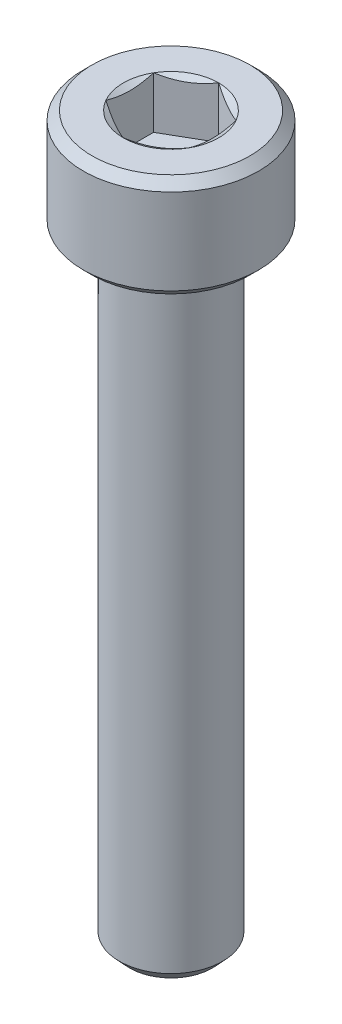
ISO-10303-21;
HEADER;
FILE_DESCRIPTION(('STEP AP214'),'2;1');
FILE_NAME('part.step','',(''),(''),'','','');
FILE_SCHEMA(('AUTOMOTIVE_DESIGN { 1 0 10303 214 1 1 1 1 }'));
ENDSEC;
DATA;
#1=APPLICATION_CONTEXT('core data for automotive mechanical design processes');
#2=APPLICATION_PROTOCOL_DEFINITION('international standard','automotive_design',2000,#1);
#3=PRODUCT_CONTEXT('',#1,'mechanical');
#4=PRODUCT('Part','Part','',(#3));
#5=PRODUCT_RELATED_PRODUCT_CATEGORY('part','',(#4));
#6=PRODUCT_DEFINITION_FORMATION('','',#4);
#7=PRODUCT_DEFINITION_CONTEXT('part definition',#1,'design');
#8=PRODUCT_DEFINITION('design','',#6,#7);
#9=PRODUCT_DEFINITION_SHAPE('','',#8);
#10=(LENGTH_UNIT() NAMED_UNIT(*) SI_UNIT(.MILLI.,.METRE.));
#11=(NAMED_UNIT(*) PLANE_ANGLE_UNIT() SI_UNIT($,.RADIAN.));
#12=(NAMED_UNIT(*) SI_UNIT($,.STERADIAN.) SOLID_ANGLE_UNIT());
#13=UNCERTAINTY_MEASURE_WITH_UNIT(LENGTH_MEASURE(1.E-05),#10,'distance_accuracy_value','');
#14=(GEOMETRIC_REPRESENTATION_CONTEXT(3) GLOBAL_UNCERTAINTY_ASSIGNED_CONTEXT((#13)) GLOBAL_UNIT_ASSIGNED_CONTEXT((#10,
#11,#12)) REPRESENTATION_CONTEXT('',''));
#15=CARTESIAN_POINT('',(0.,0.,0.));
#16=DIRECTION('',(0.,0.,1.));
#17=DIRECTION('',(1.,0.,0.));
#18=AXIS2_PLACEMENT_3D('',#15,#16,#17);
#19=CARTESIAN_POINT('',(0.,2.49999999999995,-2.3094010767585));
#20=DIRECTION('',(0.,1.,0.));
#21=DIRECTION('',(-1.,0.,0.));
#22=AXIS2_PLACEMENT_3D('',#19,#20,#21);
#23=PLANE('',#22);
#24=DIRECTION('',(0.866025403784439,0.,-0.499999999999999));
#25=VECTOR('',#24,1.);
#26=CARTESIAN_POINT('',(0.,2.49999999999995,2.3094010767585));
#27=LINE('',#26,#25);
#28=CARTESIAN_POINT('',(0.,2.49999999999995,2.30940107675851));
#29=VERTEX_POINT('',#28);
#30=CARTESIAN_POINT('',(2.,2.49999999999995,1.15470053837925));
#31=VERTEX_POINT('',#30);
#32=EDGE_CURVE('E85',#29,#31,#27,.T.);
#33=ORIENTED_EDGE('',*,*,#32,.T.);
#34=DIRECTION('',(0.,0.,1.));
#35=VECTOR('',#34,1.);
#36=CARTESIAN_POINT('',(2.,2.49999999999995,1.15470053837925));
#37=LINE('',#36,#35);
#38=CARTESIAN_POINT('',(2.,2.49999999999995,-1.15470053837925));
#39=VERTEX_POINT('',#38);
#40=EDGE_CURVE('E71',#31,#39,#37,.F.);
#41=ORIENTED_EDGE('',*,*,#40,.T.);
#42=DIRECTION('',(-0.866025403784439,0.,-0.5));
#43=VECTOR('',#42,1.);
#44=CARTESIAN_POINT('',(2.,2.49999999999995,-1.15470053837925));
#45=LINE('',#44,#43);
#46=CARTESIAN_POINT('',(0.,2.49999999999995,-2.3094010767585));
#47=VERTEX_POINT('',#46);
#48=EDGE_CURVE('E110',#39,#47,#45,.T.);
#49=ORIENTED_EDGE('',*,*,#48,.T.);
#50=DIRECTION('',(-0.86602540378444,0.,0.499999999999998));
#51=VECTOR('',#50,1.);
#52=CARTESIAN_POINT('',(0.,2.49999999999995,-2.3094010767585));
#53=LINE('',#52,#51);
#54=CARTESIAN_POINT('',(-2.,2.49999999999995,-1.15470053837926));
#55=VERTEX_POINT('',#54);
#56=EDGE_CURVE('E115',#47,#55,#53,.T.);
#57=ORIENTED_EDGE('',*,*,#56,.T.);
#58=DIRECTION('',(0.,0.,1.));
#59=VECTOR('',#58,1.);
#60=CARTESIAN_POINT('',(-2.,2.49999999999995,-1.15470053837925));
#61=LINE('',#60,#59);
#62=CARTESIAN_POINT('',(-2.,2.49999999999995,1.15470053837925));
#63=VERTEX_POINT('',#62);
#64=EDGE_CURVE('E82',#55,#63,#61,.T.);
#65=ORIENTED_EDGE('',*,*,#64,.T.);
#66=DIRECTION('',(0.866025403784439,0.,0.5));
#67=VECTOR('',#66,1.);
#68=CARTESIAN_POINT('',(-2.,2.49999999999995,1.15470053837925));
#69=LINE('',#68,#67);
#70=EDGE_CURVE('E84',#63,#29,#69,.T.);
#71=ORIENTED_EDGE('',*,*,#70,.T.);
#72=EDGE_LOOP('',(#33,#41,#49,#57,#65,#71));
#73=FACE_BOUND('',#72,.T.);
#74=ADVANCED_FACE('F17',(#73),#23,.T.);
#75=CARTESIAN_POINT('',(0.,2.49999999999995,2.3094010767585));
#76=DIRECTION('',(0.499999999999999,0.,0.866025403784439));
#77=DIRECTION('',(0.866025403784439,0.,-0.499999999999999));
#78=AXIS2_PLACEMENT_3D('',#75,#76,#77);
#79=PLANE('',#78);
#80=CARTESIAN_POINT('',(6.85276251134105E-12,5.00000000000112,2.30940107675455));
#81=CARTESIAN_POINT('',(0.087887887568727,4.97069554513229,2.25865898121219));
#82=CARTESIAN_POINT('',(0.176534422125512,4.94404467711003,2.20747888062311));
#83=CARTESIAN_POINT('',(0.355362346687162,4.89752638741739,2.10423253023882));
#84=CARTESIAN_POINT('',(0.445546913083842,4.87767542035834,2.05216444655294));
#85=CARTESIAN_POINT('',(0.624798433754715,4.84677595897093,1.94867353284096));
#86=CARTESIAN_POINT('',(0.713837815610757,4.83552178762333,1.8972666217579));
#87=CARTESIAN_POINT('',(0.892335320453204,4.82208916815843,1.79421103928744));
#88=CARTESIAN_POINT('',(0.981792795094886,4.81989959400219,1.74256274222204));
#89=CARTESIAN_POINT('',(1.14893448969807,4.82446629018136,1.64606343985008));
#90=CARTESIAN_POINT('',(1.2266437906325,4.83010128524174,1.60119795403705));
#91=CARTESIAN_POINT('',(1.38155614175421,4.84795730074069,1.51175926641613));
#92=CARTESIAN_POINT('',(1.45875865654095,4.86018441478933,1.46718637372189));
#93=CARTESIAN_POINT('',(1.61399014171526,4.89074983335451,1.3775634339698));
#94=CARTESIAN_POINT('',(1.69199947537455,4.90921764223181,1.3325247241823));
#95=CARTESIAN_POINT('',(1.84685496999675,4.951131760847,1.24311886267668));
#96=CARTESIAN_POINT('',(1.92370311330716,4.97456822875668,1.19875056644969));
#97=CARTESIAN_POINT('',(1.99999999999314,5.00000000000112,1.15470053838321));
#98=B_SPLINE_CURVE_WITH_KNOTS('',3,(#80,#81,#82,#83,#84,#85,#86,#87,#88,#89,#90,#91,#92,#93,#94,
#95,#96,#97),.UNSPECIFIED.,.F.,.F.,(4,2,2,2,2,2,2,2,4),(0.,0.317016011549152,0.63479381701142,
0.944707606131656,1.25424088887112,1.52370778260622,1.79342419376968,2.0691216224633,
2.34427797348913),.UNSPECIFIED.);
#99=CARTESIAN_POINT('',(0.,4.99999999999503,2.309401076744));
#100=VERTEX_POINT('',#99);
#101=CARTESIAN_POINT('',(1.99999999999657,4.99999999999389,1.15470053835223));
#102=VERTEX_POINT('',#101);
#103=EDGE_CURVE('E20',#100,#102,#98,.T.);
#104=ORIENTED_EDGE('',*,*,#103,.T.);
#105=DIRECTION('',(0.,1.,0.));
#106=VECTOR('',#105,1.);
#107=CARTESIAN_POINT('',(2.,2.49999999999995,1.15470053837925));
#108=LINE('',#107,#106);
#109=EDGE_CURVE('E90',#102,#31,#108,.F.);
#110=ORIENTED_EDGE('',*,*,#109,.T.);
#111=ORIENTED_EDGE('',*,*,#32,.F.);
#112=DIRECTION('',(0.,1.,0.));
#113=VECTOR('',#112,1.);
#114=CARTESIAN_POINT('',(0.,2.49999999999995,2.3094010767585));
#115=LINE('',#114,#113);
#116=EDGE_CURVE('E58',#29,#100,#115,.T.);
#117=ORIENTED_EDGE('',*,*,#116,.T.);
#118=EDGE_LOOP('',(#104,#110,#111,#117));
#119=FACE_BOUND('',#118,.T.);
#120=ADVANCED_FACE('F89',(#119),#79,.F.);
#121=CARTESIAN_POINT('',(-2.,2.49999999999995,1.15470053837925));
#122=DIRECTION('',(-0.5,0.,0.866025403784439));
#123=DIRECTION('',(0.866025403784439,0.,0.5));
#124=AXIS2_PLACEMENT_3D('',#121,#122,#123);
#125=PLANE('',#124);
#126=CARTESIAN_POINT('',(-1.99999999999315,5.00000000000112,1.15470053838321));
#127=CARTESIAN_POINT('',(-1.91211211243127,4.97069554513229,1.20544263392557));
#128=CARTESIAN_POINT('',(-1.82346557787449,4.94404467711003,1.25662273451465));
#129=CARTESIAN_POINT('',(-1.64463765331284,4.89752638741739,1.35986908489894));
#130=CARTESIAN_POINT('',(-1.55445308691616,4.87767542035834,1.41193716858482));
#131=CARTESIAN_POINT('',(-1.37520156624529,4.84677595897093,1.51542808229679));
#132=CARTESIAN_POINT('',(-1.28616218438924,4.83552178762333,1.56683499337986));
#133=CARTESIAN_POINT('',(-1.1076646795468,4.82208916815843,1.66989057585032));
#134=CARTESIAN_POINT('',(-1.01820720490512,4.81989959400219,1.72153887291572));
#135=CARTESIAN_POINT('',(-0.851065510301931,4.82446629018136,1.81803817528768));
#136=CARTESIAN_POINT('',(-0.7733562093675,4.83010128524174,1.86290366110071));
#137=CARTESIAN_POINT('',(-0.618443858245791,4.84795730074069,1.95234234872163));
#138=CARTESIAN_POINT('',(-0.541241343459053,4.86018441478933,1.99691524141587));
#139=CARTESIAN_POINT('',(-0.386009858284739,4.89074983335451,2.08653818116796));
#140=CARTESIAN_POINT('',(-0.308000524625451,4.90921764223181,2.13157689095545));
#141=CARTESIAN_POINT('',(-0.15314503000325,4.951131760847,2.22098275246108));
#142=CARTESIAN_POINT('',(-0.076296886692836,4.97456822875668,2.26535104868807));
#143=CARTESIAN_POINT('',(-6.85765127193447E-12,5.00000000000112,2.30940107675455));
#144=B_SPLINE_CURVE_WITH_KNOTS('',3,(#126,#127,#128,#129,#130,#131,#132,#133,#134,#135,#136,
#137,#138,#139,#140,#141,#142,#143),.UNSPECIFIED.,.F.,.F.,(4,2,2,2,2,2,2,2,4),(0.,
0.317016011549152,0.634793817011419,0.944707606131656,1.25424088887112,1.52370778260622,
1.79342419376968,2.0691216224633,2.34427797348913),.UNSPECIFIED.);
#145=CARTESIAN_POINT('',(-1.99999999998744,4.99999999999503,1.154700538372));
#146=VERTEX_POINT('',#145);
#147=EDGE_CURVE('E94',#146,#100,#144,.T.);
#148=ORIENTED_EDGE('',*,*,#147,.T.);
#149=ORIENTED_EDGE('',*,*,#116,.F.);
#150=ORIENTED_EDGE('',*,*,#70,.F.);
#151=DIRECTION('',(0.,-1.,0.));
#152=VECTOR('',#151,1.);
#153=CARTESIAN_POINT('',(-2.,2.49999999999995,1.15470053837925));
#154=LINE('',#153,#152);
#155=EDGE_CURVE('E96',#63,#146,#154,.F.);
#156=ORIENTED_EDGE('',*,*,#155,.T.);
#157=EDGE_LOOP('',(#148,#149,#150,#156));
#158=FACE_BOUND('',#157,.T.);
#159=ADVANCED_FACE('F92',(#158),#125,.F.);
#160=CARTESIAN_POINT('',(-2.,2.49999999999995,-1.15470053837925));
#161=DIRECTION('',(-1.,0.,0.));
#162=DIRECTION('',(0.,-1.,0.));
#163=AXIS2_PLACEMENT_3D('',#160,#161,#162);
#164=PLANE('',#163);
#165=CARTESIAN_POINT('',(-2.,5.00000000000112,-1.15470053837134));
#166=CARTESIAN_POINT('',(-2.,4.97069554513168,-1.05321634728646));
#167=CARTESIAN_POINT('',(-2.,4.94404467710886,-0.950856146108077));
#168=CARTESIAN_POINT('',(-2.,4.89752638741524,-0.744363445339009));
#169=CARTESIAN_POINT('',(-2.,4.87767542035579,-0.640227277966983));
#170=CARTESIAN_POINT('',(-2.,4.84677595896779,-0.433245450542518));
#171=CARTESIAN_POINT('',(-2.,4.83552178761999,-0.330431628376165));
#172=CARTESIAN_POINT('',(-2.,4.82208916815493,-0.124320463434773));
#173=CARTESIAN_POINT('',(-2.,4.81989959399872,-0.0210238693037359));
#174=CARTESIAN_POINT('',(-2.,4.82446629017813,0.171974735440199));
#175=CARTESIAN_POINT('',(-2.,4.83010128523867,0.261705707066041));
#176=CARTESIAN_POINT('',(-2.,4.84795730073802,0.440583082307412));
#177=CARTESIAN_POINT('',(-2.,4.8601844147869,0.529728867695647));
#178=CARTESIAN_POINT('',(-2.,4.89074983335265,0.708974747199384));
#179=CARTESIAN_POINT('',(-2.,4.90921764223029,0.799052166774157));
#180=CARTESIAN_POINT('',(-2.,4.9511317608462,0.977863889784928));
#181=CARTESIAN_POINT('',(-2.,4.97456822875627,1.06660048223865));
#182=CARTESIAN_POINT('',(-2.,5.00000000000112,1.15470053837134));
#183=B_SPLINE_CURVE_WITH_KNOTS('',3,(#165,#166,#167,#168,#169,#170,#171,#172,#173,#174,#175,
#176,#177,#178,#179,#180,#181,#182),.UNSPECIFIED.,.F.,.F.,(4,2,2,2,2,2,2,2,4),(0.,
0.317016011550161,0.634793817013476,0.94470760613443,1.25424088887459,1.52370778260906,
1.79342419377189,2.06912162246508,2.34427797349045),.UNSPECIFIED.);
#184=CARTESIAN_POINT('',(-1.99999999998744,4.99999999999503,-1.15470053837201));
#185=VERTEX_POINT('',#184);
#186=EDGE_CURVE('E195',#185,#146,#183,.T.);
#187=ORIENTED_EDGE('',*,*,#186,.T.);
#188=ORIENTED_EDGE('',*,*,#155,.F.);
#189=ORIENTED_EDGE('',*,*,#64,.F.);
#190=DIRECTION('',(0.,1.,0.));
#191=VECTOR('',#190,1.);
#192=CARTESIAN_POINT('',(-2.,2.49999999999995,-1.15470053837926));
#193=LINE('',#192,#191);
#194=EDGE_CURVE('E112',#55,#185,#193,.T.);
#195=ORIENTED_EDGE('',*,*,#194,.T.);
#196=EDGE_LOOP('',(#187,#188,#189,#195));
#197=FACE_BOUND('',#196,.T.);
#198=ADVANCED_FACE('F204',(#197),#164,.F.);
#199=CARTESIAN_POINT('',(0.,2.49999999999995,-2.3094010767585));
#200=DIRECTION('',(-0.499999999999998,0.,-0.86602540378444));
#201=DIRECTION('',(-0.86602540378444,0.,0.499999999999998));
#202=AXIS2_PLACEMENT_3D('',#199,#200,#201);
#203=PLANE('',#202);
#204=CARTESIAN_POINT('',(-6.85499212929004E-12,5.00000000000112,-2.30940107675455));
#205=CARTESIAN_POINT('',(-0.0878878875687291,4.97069554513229,-2.25865898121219));
#206=CARTESIAN_POINT('',(-0.176534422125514,4.94404467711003,-2.2074788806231));
#207=CARTESIAN_POINT('',(-0.355362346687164,4.89752638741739,-2.10423253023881));
#208=CARTESIAN_POINT('',(-0.445546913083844,4.87767542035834,-2.05216444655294));
#209=CARTESIAN_POINT('',(-0.624798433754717,4.84677595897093,-1.94867353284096));
#210=CARTESIAN_POINT('',(-0.713837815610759,4.83552178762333,-1.8972666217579));
#211=CARTESIAN_POINT('',(-0.892335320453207,4.82208916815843,-1.79421103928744));
#212=CARTESIAN_POINT('',(-0.981792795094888,4.81989959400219,-1.74256274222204));
#213=CARTESIAN_POINT('',(-1.14893448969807,4.82446629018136,-1.64606343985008));
#214=CARTESIAN_POINT('',(-1.2266437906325,4.83010128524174,-1.60119795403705));
#215=CARTESIAN_POINT('',(-1.38155614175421,4.84795730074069,-1.51175926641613));
#216=CARTESIAN_POINT('',(-1.45875865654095,4.86018441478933,-1.4671863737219));
#217=CARTESIAN_POINT('',(-1.61399014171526,4.89074983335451,-1.3775634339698));
#218=CARTESIAN_POINT('',(-1.69199947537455,4.90921764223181,-1.33252472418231));
#219=CARTESIAN_POINT('',(-1.84685496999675,4.951131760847,-1.24311886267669));
#220=CARTESIAN_POINT('',(-1.92370311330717,4.97456822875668,-1.1987505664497));
#221=CARTESIAN_POINT('',(-1.99999999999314,5.00000000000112,-1.15470053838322));
#222=B_SPLINE_CURVE_WITH_KNOTS('',3,(#204,#205,#206,#207,#208,#209,#210,#211,#212,#213,#214,
#215,#216,#217,#218,#219,#220,#221),.UNSPECIFIED.,.F.,.F.,(4,2,2,2,2,2,2,2,4),(0.,
0.317016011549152,0.634793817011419,0.944707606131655,1.25424088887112,1.52370778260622,
1.79342419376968,2.0691216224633,2.34427797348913),.UNSPECIFIED.);
#223=CARTESIAN_POINT('',(0.,4.99999999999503,-2.309401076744));
#224=VERTEX_POINT('',#223);
#225=EDGE_CURVE('E188',#224,#185,#222,.T.);
#226=ORIENTED_EDGE('',*,*,#225,.T.);
#227=ORIENTED_EDGE('',*,*,#194,.F.);
#228=ORIENTED_EDGE('',*,*,#56,.F.);
#229=DIRECTION('',(0.,1.,0.));
#230=VECTOR('',#229,1.);
#231=CARTESIAN_POINT('',(0.,2.49999999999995,-2.3094010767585));
#232=LINE('',#231,#230);
#233=EDGE_CURVE('E107',#47,#224,#232,.T.);
#234=ORIENTED_EDGE('',*,*,#233,.T.);
#235=EDGE_LOOP('',(#226,#227,#228,#234));
#236=FACE_BOUND('',#235,.T.);
#237=ADVANCED_FACE('F200',(#236),#203,.F.);
#238=CARTESIAN_POINT('',(2.,2.49999999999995,-1.15470053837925));
#239=DIRECTION('',(0.5,0.,-0.866025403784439));
#240=DIRECTION('',(-0.866025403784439,0.,-0.5));
#241=AXIS2_PLACEMENT_3D('',#238,#239,#240);
#242=PLANE('',#241);
#243=CARTESIAN_POINT('',(1.99999999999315,5.00000000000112,-1.15470053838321));
#244=CARTESIAN_POINT('',(1.91211211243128,4.97069554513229,-1.20544263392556));
#245=CARTESIAN_POINT('',(1.82346557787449,4.94404467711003,-1.25662273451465));
#246=CARTESIAN_POINT('',(1.64463765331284,4.89752638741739,-1.35986908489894));
#247=CARTESIAN_POINT('',(1.55445308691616,4.87767542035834,-1.41193716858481));
#248=CARTESIAN_POINT('',(1.37520156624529,4.84677595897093,-1.51542808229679));
#249=CARTESIAN_POINT('',(1.28616218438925,4.83552178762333,-1.56683499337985));
#250=CARTESIAN_POINT('',(1.1076646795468,4.82208916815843,-1.66989057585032));
#251=CARTESIAN_POINT('',(1.01820720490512,4.81989959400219,-1.72153887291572));
#252=CARTESIAN_POINT('',(0.851065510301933,4.82446629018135,-1.81803817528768));
#253=CARTESIAN_POINT('',(0.773356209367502,4.83010128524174,-1.86290366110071));
#254=CARTESIAN_POINT('',(0.618443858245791,4.84795730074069,-1.95234234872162));
#255=CARTESIAN_POINT('',(0.541241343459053,4.86018441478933,-1.99691524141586));
#256=CARTESIAN_POINT('',(0.386009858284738,4.8907498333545,-2.08653818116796));
#257=CARTESIAN_POINT('',(0.30800052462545,4.90921764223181,-2.13157689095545));
#258=CARTESIAN_POINT('',(0.153145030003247,4.951131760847,-2.22098275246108));
#259=CARTESIAN_POINT('',(0.0762968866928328,4.97456822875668,-2.26535104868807));
#260=CARTESIAN_POINT('',(6.85395999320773E-12,5.00000000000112,-2.30940107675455));
#261=B_SPLINE_CURVE_WITH_KNOTS('',3,(#243,#244,#245,#246,#247,#248,#249,#250,#251,#252,#253,
#254,#255,#256,#257,#258,#259,#260),.UNSPECIFIED.,.F.,.F.,(4,2,2,2,2,2,2,2,4),(0.,
0.317016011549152,0.63479381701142,0.944707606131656,1.25424088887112,1.52370778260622,
1.79342419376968,2.06912162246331,2.34427797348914),.UNSPECIFIED.);
#262=CARTESIAN_POINT('',(1.99999999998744,4.99999999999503,-1.154700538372));
#263=VERTEX_POINT('',#262);
#264=EDGE_CURVE('E159',#263,#224,#261,.T.);
#265=ORIENTED_EDGE('',*,*,#264,.T.);
#266=ORIENTED_EDGE('',*,*,#233,.F.);
#267=ORIENTED_EDGE('',*,*,#48,.F.);
#268=DIRECTION('',(0.,1.,0.));
#269=VECTOR('',#268,1.);
#270=CARTESIAN_POINT('',(2.,2.49999999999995,-1.15470053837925));
#271=LINE('',#270,#269);
#272=EDGE_CURVE('E39',#39,#263,#271,.T.);
#273=ORIENTED_EDGE('',*,*,#272,.T.);
#274=EDGE_LOOP('',(#265,#266,#267,#273));
#275=FACE_BOUND('',#274,.T.);
#276=ADVANCED_FACE('F203',(#275),#242,.F.);
#277=CARTESIAN_POINT('',(2.,2.49999999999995,1.15470053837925));
#278=DIRECTION('',(1.,0.,0.));
#279=DIRECTION('',(0.,1.,0.));
#280=AXIS2_PLACEMENT_3D('',#277,#278,#279);
#281=PLANE('',#280);
#282=CARTESIAN_POINT('',(2.,5.00000000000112,1.15470053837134));
#283=CARTESIAN_POINT('',(2.,4.97069554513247,1.05321634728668));
#284=CARTESIAN_POINT('',(2.,4.94404467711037,0.950856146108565));
#285=CARTESIAN_POINT('',(2.,4.89752638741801,0.744363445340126));
#286=CARTESIAN_POINT('',(2.,4.87767542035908,0.640227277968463));
#287=CARTESIAN_POINT('',(2.,4.84677595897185,0.433245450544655));
#288=CARTESIAN_POINT('',(2.,4.8355217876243,0.330431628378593));
#289=CARTESIAN_POINT('',(2.,4.82208916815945,0.124320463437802));
#290=CARTESIAN_POINT('',(2.,4.8198995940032,0.0210238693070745));
#291=CARTESIAN_POINT('',(2.,4.82446629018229,-0.171974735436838));
#292=CARTESIAN_POINT('',(2.,4.83010128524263,-0.261705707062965));
#293=CARTESIAN_POINT('',(2.,4.84795730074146,-0.440583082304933));
#294=CARTESIAN_POINT('',(2.,4.86018441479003,-0.529728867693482));
#295=CARTESIAN_POINT('',(2.,4.89074983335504,-0.708974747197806));
#296=CARTESIAN_POINT('',(2.,4.90921764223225,-0.799052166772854));
#297=CARTESIAN_POINT('',(2.,4.95113176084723,-0.977863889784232));
#298=CARTESIAN_POINT('',(2.,4.97456822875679,-1.06660048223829));
#299=CARTESIAN_POINT('',(2.,5.00000000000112,-1.15470053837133));
#300=B_SPLINE_CURVE_WITH_KNOTS('',3,(#282,#283,#284,#285,#286,#287,#288,#289,#290,#291,#292,
#293,#294,#295,#296,#297,#298,#299),.UNSPECIFIED.,.F.,.F.,(4,2,2,2,2,2,2,2,4),(0.,
0.317016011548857,0.634793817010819,0.944707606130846,1.25424088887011,1.52370778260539,
1.79342419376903,2.06912162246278,2.34427797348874),.UNSPECIFIED.);
#301=EDGE_CURVE('E152',#102,#263,#300,.T.);
#302=ORIENTED_EDGE('',*,*,#301,.T.);
#303=ORIENTED_EDGE('',*,*,#272,.F.);
#304=ORIENTED_EDGE('',*,*,#40,.F.);
#305=ORIENTED_EDGE('',*,*,#109,.F.);
#306=EDGE_LOOP('',(#302,#303,#304,#305));
#307=FACE_BOUND('',#306,.T.);
#308=ADVANCED_FACE('F166',(#307),#281,.F.);
#309=CARTESIAN_POINT('',(0.,5.0000000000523,0.));
#310=DIRECTION('',(0.,1.,0.));
#311=DIRECTION('',(0.,0.,1.));
#312=AXIS2_PLACEMENT_3D('',#309,#310,#311);
#313=CONICAL_SURFACE('',#312,2.30940107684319,1.04719755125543);
#314=ORIENTED_EDGE('',*,*,#103,.F.);
#315=CARTESIAN_POINT('',(0.,4.99999999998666,0.));
#316=DIRECTION('',(0.,1.,0.));
#317=DIRECTION('',(0.,0.,1.));
#318=AXIS2_PLACEMENT_3D('',#315,#316,#317);
#319=CIRCLE('',#318,2.3094010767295);
#320=EDGE_CURVE('E149',#102,#100,#319,.F.);
#321=ORIENTED_EDGE('',*,*,#320,.F.);
#322=EDGE_LOOP('',(#314,#321));
#323=FACE_BOUND('',#322,.T.);
#324=ADVANCED_FACE('F220',(#323),#313,.F.);
#325=CARTESIAN_POINT('',(0.,5.0000000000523,0.));
#326=DIRECTION('',(0.,1.,0.));
#327=DIRECTION('',(0.,0.,1.));
#328=AXIS2_PLACEMENT_3D('',#325,#326,#327);
#329=CONICAL_SURFACE('',#328,2.30940107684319,1.04719755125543);
#330=ORIENTED_EDGE('',*,*,#147,.F.);
#331=CARTESIAN_POINT('',(0.,4.99999999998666,0.));
#332=DIRECTION('',(0.,1.,0.));
#333=DIRECTION('',(0.,0.,1.));
#334=AXIS2_PLACEMENT_3D('',#331,#332,#333);
#335=CIRCLE('',#334,2.3094010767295);
#336=EDGE_CURVE('E146',#100,#146,#335,.F.);
#337=ORIENTED_EDGE('',*,*,#336,.F.);
#338=EDGE_LOOP('',(#330,#337));
#339=FACE_BOUND('',#338,.T.);
#340=ADVANCED_FACE('F217',(#339),#329,.F.);
#341=CARTESIAN_POINT('',(0.,5.0000000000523,0.));
#342=DIRECTION('',(0.,1.,0.));
#343=DIRECTION('',(0.,0.,1.));
#344=AXIS2_PLACEMENT_3D('',#341,#342,#343);
#345=CONICAL_SURFACE('',#344,2.30940107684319,1.04719755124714);
#346=ORIENTED_EDGE('',*,*,#186,.F.);
#347=CARTESIAN_POINT('',(0.,4.99999999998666,0.));
#348=DIRECTION('',(0.,1.,0.));
#349=DIRECTION('',(0.,0.,1.));
#350=AXIS2_PLACEMENT_3D('',#347,#348,#349);
#351=CIRCLE('',#350,2.3094010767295);
#352=EDGE_CURVE('E143',#146,#185,#351,.F.);
#353=ORIENTED_EDGE('',*,*,#352,.F.);
#354=EDGE_LOOP('',(#346,#353));
#355=FACE_BOUND('',#354,.T.);
#356=ADVANCED_FACE('F184',(#355),#345,.F.);
#357=CARTESIAN_POINT('',(0.,5.0000000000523,0.));
#358=DIRECTION('',(0.,1.,0.));
#359=DIRECTION('',(0.,0.,1.));
#360=AXIS2_PLACEMENT_3D('',#357,#358,#359);
#361=CONICAL_SURFACE('',#360,2.30940107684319,1.04719755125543);
#362=ORIENTED_EDGE('',*,*,#225,.F.);
#363=CARTESIAN_POINT('',(0.,4.99999999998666,0.));
#364=DIRECTION('',(0.,1.,0.));
#365=DIRECTION('',(0.,0.,1.));
#366=AXIS2_PLACEMENT_3D('',#363,#364,#365);
#367=CIRCLE('',#366,2.3094010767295);
#368=EDGE_CURVE('E140',#185,#224,#367,.F.);
#369=ORIENTED_EDGE('',*,*,#368,.F.);
#370=EDGE_LOOP('',(#362,#369));
#371=FACE_BOUND('',#370,.T.);
#372=ADVANCED_FACE('F179',(#371),#361,.F.);
#373=CARTESIAN_POINT('',(0.,5.0000000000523,0.));
#374=DIRECTION('',(0.,1.,0.));
#375=DIRECTION('',(0.,0.,1.));
#376=AXIS2_PLACEMENT_3D('',#373,#374,#375);
#377=CONICAL_SURFACE('',#376,2.30940107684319,1.04719755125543);
#378=ORIENTED_EDGE('',*,*,#264,.F.);
#379=CARTESIAN_POINT('',(0.,4.99999999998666,0.));
#380=DIRECTION('',(0.,1.,0.));
#381=DIRECTION('',(0.,0.,1.));
#382=AXIS2_PLACEMENT_3D('',#379,#380,#381);
#383=CIRCLE('',#382,2.3094010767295);
#384=EDGE_CURVE('E137',#224,#263,#383,.F.);
#385=ORIENTED_EDGE('',*,*,#384,.F.);
#386=EDGE_LOOP('',(#378,#385));
#387=FACE_BOUND('',#386,.T.);
#388=ADVANCED_FACE('F173',(#387),#377,.F.);
#389=CARTESIAN_POINT('',(0.,5.0000000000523,0.));
#390=DIRECTION('',(0.,1.,0.));
#391=DIRECTION('',(0.,0.,1.));
#392=AXIS2_PLACEMENT_3D('',#389,#390,#391);
#393=CONICAL_SURFACE('',#392,2.30940107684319,1.04719755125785);
#394=ORIENTED_EDGE('',*,*,#301,.F.);
#395=CARTESIAN_POINT('',(0.,4.99999999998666,0.));
#396=DIRECTION('',(0.,1.,0.));
#397=DIRECTION('',(0.,0.,1.));
#398=AXIS2_PLACEMENT_3D('',#395,#396,#397);
#399=CIRCLE('',#398,2.3094010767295);
#400=EDGE_CURVE('E134',#263,#102,#399,.F.);
#401=ORIENTED_EDGE('',*,*,#400,.F.);
#402=EDGE_LOOP('',(#394,#401));
#403=FACE_BOUND('',#402,.T.);
#404=ADVANCED_FACE('F168',(#403),#393,.F.);
#405=CARTESIAN_POINT('',(0.,5.,0.));
#406=DIRECTION('',(0.,1.,0.));
#407=DIRECTION('',(-1.,0.,0.));
#408=AXIS2_PLACEMENT_3D('',#405,#406,#407);
#409=PLANE('',#408);
#410=ORIENTED_EDGE('',*,*,#384,.T.);
#411=ORIENTED_EDGE('',*,*,#400,.T.);
#412=ORIENTED_EDGE('',*,*,#320,.T.);
#413=ORIENTED_EDGE('',*,*,#336,.T.);
#414=ORIENTED_EDGE('',*,*,#352,.T.);
#415=ORIENTED_EDGE('',*,*,#368,.T.);
#416=EDGE_LOOP('',(#410,#411,#412,#413,#414,#415));
#417=FACE_BOUND('',#416,.T.);
#418=CARTESIAN_POINT('',(0.,4.99999999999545,0.));
#419=DIRECTION('',(0.,-1.,0.));
#420=DIRECTION('',(0.,0.,-1.));
#421=AXIS2_PLACEMENT_3D('',#418,#419,#420);
#422=CIRCLE('',#421,3.82500000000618);
#423=CARTESIAN_POINT('',(0.,4.99999999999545,-3.82500000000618));
#424=VERTEX_POINT('',#423);
#425=EDGE_CURVE('E130',#424,#424,#422,.T.);
#426=ORIENTED_EDGE('',*,*,#425,.F.);
#427=EDGE_LOOP('',(#426));
#428=FACE_BOUND('',#427,.T.);
#429=ADVANCED_FACE('F172',(#417,#428),#409,.T.);
#430=CARTESIAN_POINT('',(0.,4.57499999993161,0.));
#431=DIRECTION('',(0.,-1.,0.));
#432=DIRECTION('',(0.,0.,-1.));
#433=AXIS2_PLACEMENT_3D('',#430,#431,#432);
#434=CONICAL_SURFACE('',#433,4.25000000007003,0.785398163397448);
#435=ORIENTED_EDGE('',*,*,#425,.T.);
#436=EDGE_LOOP('',(#435));
#437=FACE_BOUND('',#436,.T.);
#438=CARTESIAN_POINT('',(0.,4.575,0.));
#439=DIRECTION('',(0.,-1.,0.));
#440=DIRECTION('',(1.,0.,0.));
#441=AXIS2_PLACEMENT_3D('',#438,#439,#440);
#442=CIRCLE('',#441,4.25);
#443=CARTESIAN_POINT('',(4.25,4.575,0.));
#444=VERTEX_POINT('',#443);
#445=EDGE_CURVE('E133',#444,#444,#442,.T.);
#446=ORIENTED_EDGE('',*,*,#445,.F.);
#447=EDGE_LOOP('',(#446));
#448=FACE_BOUND('',#447,.T.);
#449=ADVANCED_FACE('F256',(#437,#448),#434,.T.);
#450=CARTESIAN_POINT('',(0.,5.,0.));
#451=DIRECTION('',(0.,-1.,0.));
#452=DIRECTION('',(1.,0.,0.));
#453=AXIS2_PLACEMENT_3D('',#450,#451,#452);
#454=CYLINDRICAL_SURFACE('',#453,4.25);
#455=ORIENTED_EDGE('',*,*,#445,.T.);
#456=EDGE_LOOP('',(#455));
#457=FACE_BOUND('',#456,.T.);
#458=CARTESIAN_POINT('',(0.,0.425000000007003,0.));
#459=DIRECTION('',(0.,1.,0.));
#460=DIRECTION('',(0.,0.,1.));
#461=AXIS2_PLACEMENT_3D('',#458,#459,#460);
#462=CIRCLE('',#461,4.24999999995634);
#463=CARTESIAN_POINT('',(0.,0.425000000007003,4.24999999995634));
#464=VERTEX_POINT('',#463);
#465=EDGE_CURVE('E129',#464,#464,#462,.F.);
#466=ORIENTED_EDGE('',*,*,#465,.F.);
#467=EDGE_LOOP('',(#466));
#468=FACE_BOUND('',#467,.T.);
#469=ADVANCED_FACE('F253',(#457,#468),#454,.T.);
#470=CARTESIAN_POINT('',(0.,-30.,0.));
#471=DIRECTION('',(0.,1.,0.));
#472=DIRECTION('',(-1.,0.,0.));
#473=AXIS2_PLACEMENT_3D('',#470,#471,#472);
#474=PLANE('',#473);
#475=CARTESIAN_POINT('',(0.,-30.0000000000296,0.));
#476=DIRECTION('',(0.,1.,0.));
#477=DIRECTION('',(-1.,0.,0.));
#478=AXIS2_PLACEMENT_3D('',#475,#476,#477);
#479=CIRCLE('',#478,1.99999999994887);
#480=CARTESIAN_POINT('',(-1.99999999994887,-30.0000000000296,0.));
#481=VERTEX_POINT('',#480);
#482=EDGE_CURVE('E126',#481,#481,#479,.T.);
#483=ORIENTED_EDGE('',*,*,#482,.F.);
#484=EDGE_LOOP('',(#483));
#485=FACE_BOUND('',#484,.T.);
#486=ADVANCED_FACE('F249',(#485),#474,.F.);
#487=CARTESIAN_POINT('',(0.,0.425000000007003,0.));
#488=DIRECTION('',(0.,1.,0.));
#489=DIRECTION('',(-1.,0.,0.));
#490=AXIS2_PLACEMENT_3D('',#487,#488,#489);
#491=CONICAL_SURFACE('',#490,4.24999999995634,0.785398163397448);
#492=CARTESIAN_POINT('',(0.,5.6843418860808E-11,0.));
#493=DIRECTION('',(0.,1.,0.));
#494=DIRECTION('',(-1.,0.,0.));
#495=AXIS2_PLACEMENT_3D('',#492,#493,#494);
#496=CIRCLE('',#495,3.82500000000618);
#497=CARTESIAN_POINT('',(-3.82500000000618,5.68434432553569E-11,0.));
#498=VERTEX_POINT('',#497);
#499=EDGE_CURVE('E123',#498,#498,#496,.T.);
#500=ORIENTED_EDGE('',*,*,#499,.T.);
#501=EDGE_LOOP('',(#500));
#502=FACE_BOUND('',#501,.T.);
#503=ORIENTED_EDGE('',*,*,#465,.T.);
#504=EDGE_LOOP('',(#503));
#505=FACE_BOUND('',#504,.T.);
#506=ADVANCED_FACE('F245',(#502,#505),#491,.T.);
#507=CARTESIAN_POINT('',(0.,-29.4638156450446,0.));
#508=DIRECTION('',(0.,1.,0.));
#509=DIRECTION('',(-1.,0.,0.));
#510=AXIS2_PLACEMENT_3D('',#507,#508,#509);
#511=CONICAL_SURFACE('',#510,2.49999999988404,0.750491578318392);
#512=CARTESIAN_POINT('',(0.,-29.4638156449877,0.));
#513=DIRECTION('',(0.,1.,0.));
#514=DIRECTION('',(-1.,0.,0.));
#515=AXIS2_PLACEMENT_3D('',#512,#513,#514);
#516=CIRCLE('',#515,2.5);
#517=CARTESIAN_POINT('',(-2.5,-29.4638156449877,0.));
#518=VERTEX_POINT('',#517);
#519=EDGE_CURVE('E30',#518,#518,#516,.T.);
#520=ORIENTED_EDGE('',*,*,#519,.F.);
#521=EDGE_LOOP('',(#520));
#522=FACE_BOUND('',#521,.T.);
#523=ORIENTED_EDGE('',*,*,#482,.T.);
#524=EDGE_LOOP('',(#523));
#525=FACE_BOUND('',#524,.T.);
#526=ADVANCED_FACE('F238',(#522,#525),#511,.T.);
#527=CARTESIAN_POINT('',(0.,0.,0.));
#528=DIRECTION('',(0.,1.,0.));
#529=DIRECTION('',(-1.,0.,0.));
#530=AXIS2_PLACEMENT_3D('',#527,#528,#529);
#531=PLANE('',#530);
#532=CARTESIAN_POINT('',(0.,0.,0.));
#533=DIRECTION('',(0.,1.,0.));
#534=DIRECTION('',(-1.,0.,0.));
#535=AXIS2_PLACEMENT_3D('',#532,#533,#534);
#536=CIRCLE('',#535,2.5);
#537=CARTESIAN_POINT('',(-2.5,0.,0.));
#538=VERTEX_POINT('',#537);
#539=EDGE_CURVE('E11',#538,#538,#536,.F.);
#540=ORIENTED_EDGE('',*,*,#539,.F.);
#541=EDGE_LOOP('',(#540));
#542=FACE_BOUND('',#541,.T.);
#543=ORIENTED_EDGE('',*,*,#499,.F.);
#544=EDGE_LOOP('',(#543));
#545=FACE_BOUND('',#544,.T.);
#546=ADVANCED_FACE('F232',(#542,#545),#531,.F.);
#547=CARTESIAN_POINT('',(0.,-30.,0.));
#548=DIRECTION('',(0.,1.,0.));
#549=DIRECTION('',(-1.,0.,0.));
#550=AXIS2_PLACEMENT_3D('',#547,#548,#549);
#551=CYLINDRICAL_SURFACE('',#550,2.5);
#552=ORIENTED_EDGE('',*,*,#539,.T.);
#553=EDGE_LOOP('',(#552));
#554=FACE_BOUND('',#553,.T.);
#555=ORIENTED_EDGE('',*,*,#519,.T.);
#556=EDGE_LOOP('',(#555));
#557=FACE_BOUND('',#556,.T.);
#558=ADVANCED_FACE('F230',(#554,#557),#551,.T.);
#559=CLOSED_SHELL('',(#74,#120,#159,#198,#237,#276,#308,#324,#340,#356,#372,#388,#404,#429,#449,
#469,#486,#506,#526,#546,#558));
#560=MANIFOLD_SOLID_BREP('B1',#559);
#561=ADVANCED_BREP_SHAPE_REPRESENTATION('',(#18,#560),#14);
#562=SHAPE_DEFINITION_REPRESENTATION(#9,#561);
ENDSEC;
END-ISO-10303-21;
